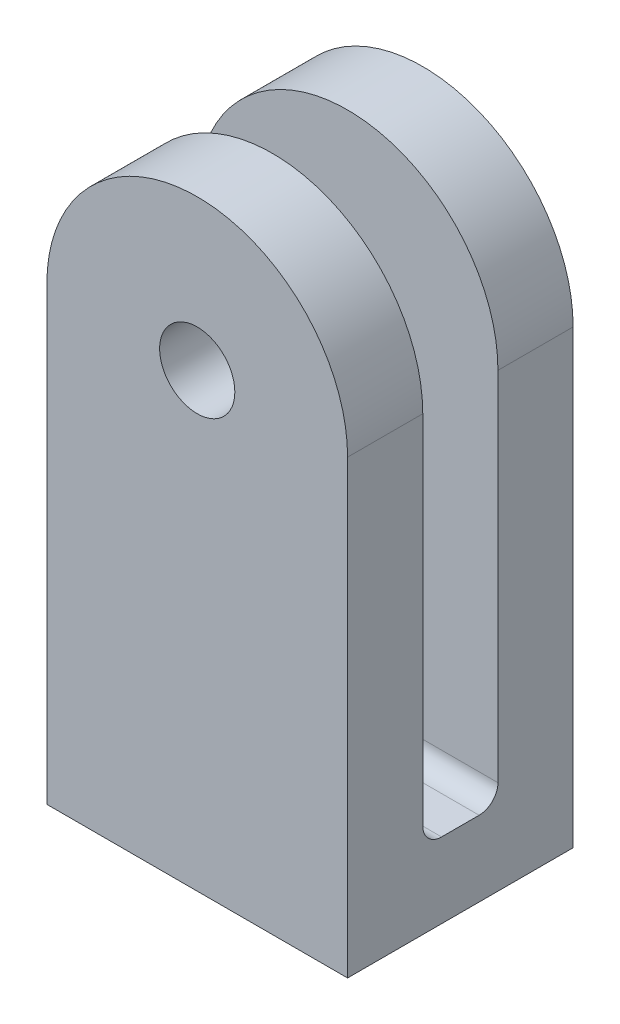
ISO-10303-21;
HEADER;
FILE_DESCRIPTION(('STEP AP214'),'2;1');
FILE_NAME('part.step','',(''),(''),'','','');
FILE_SCHEMA(('AUTOMOTIVE_DESIGN { 1 0 10303 214 1 1 1 1 }'));
ENDSEC;
DATA;
#1=APPLICATION_CONTEXT('core data for automotive mechanical design processes');
#2=APPLICATION_PROTOCOL_DEFINITION('international standard','automotive_design',2000,#1);
#3=PRODUCT_CONTEXT('',#1,'mechanical');
#4=PRODUCT('Part','Part','',(#3));
#5=PRODUCT_RELATED_PRODUCT_CATEGORY('part','',(#4));
#6=PRODUCT_DEFINITION_FORMATION('','',#4);
#7=PRODUCT_DEFINITION_CONTEXT('part definition',#1,'design');
#8=PRODUCT_DEFINITION('design','',#6,#7);
#9=PRODUCT_DEFINITION_SHAPE('','',#8);
#10=(LENGTH_UNIT() NAMED_UNIT(*) SI_UNIT(.MILLI.,.METRE.));
#11=(NAMED_UNIT(*) PLANE_ANGLE_UNIT() SI_UNIT($,.RADIAN.));
#12=(NAMED_UNIT(*) SI_UNIT($,.STERADIAN.) SOLID_ANGLE_UNIT());
#13=UNCERTAINTY_MEASURE_WITH_UNIT(LENGTH_MEASURE(1.E-05),#10,'distance_accuracy_value','');
#14=(GEOMETRIC_REPRESENTATION_CONTEXT(3) GLOBAL_UNCERTAINTY_ASSIGNED_CONTEXT((#13)) GLOBAL_UNIT_ASSIGNED_CONTEXT((#10,
#11,#12)) REPRESENTATION_CONTEXT('',''));
#15=CARTESIAN_POINT('',(0.,0.,0.));
#16=DIRECTION('',(0.,0.,1.));
#17=DIRECTION('',(1.,0.,0.));
#18=AXIS2_PLACEMENT_3D('',#15,#16,#17);
#19=CARTESIAN_POINT('',(0.,76.2,19.05));
#20=DIRECTION('',(0.,0.,-1.));
#21=DIRECTION('',(-1.,0.,0.));
#22=AXIS2_PLACEMENT_3D('',#19,#20,#21);
#23=CYLINDRICAL_SURFACE('',#22,25.4);
#24=DIRECTION('',(0.,0.,-1.));
#25=VECTOR('',#24,1.);
#26=CARTESIAN_POINT('',(25.4,76.2,19.05));
#27=LINE('',#26,#25);
#28=CARTESIAN_POINT('',(25.4,76.2,19.05));
#29=VERTEX_POINT('',#28);
#30=CARTESIAN_POINT('',(25.4,76.2,6.35000000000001));
#31=VERTEX_POINT('',#30);
#32=EDGE_CURVE('E184',#29,#31,#27,.T.);
#33=ORIENTED_EDGE('',*,*,#32,.T.);
#34=CARTESIAN_POINT('',(0.,76.2,6.35000000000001));
#35=DIRECTION('',(0.,0.,1.));
#36=DIRECTION('',(0.,-1.,0.));
#37=AXIS2_PLACEMENT_3D('',#34,#35,#36);
#38=CIRCLE('',#37,25.4);
#39=CARTESIAN_POINT('',(-25.4,76.2,6.35000000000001));
#40=VERTEX_POINT('',#39);
#41=EDGE_CURVE('E11',#31,#40,#38,.T.);
#42=ORIENTED_EDGE('',*,*,#41,.T.);
#43=DIRECTION('',(0.,0.,-1.));
#44=VECTOR('',#43,1.);
#45=CARTESIAN_POINT('',(-25.4,76.2,19.05));
#46=LINE('',#45,#44);
#47=CARTESIAN_POINT('',(-25.4,76.2,19.05));
#48=VERTEX_POINT('',#47);
#49=EDGE_CURVE('E141',#48,#40,#46,.T.);
#50=ORIENTED_EDGE('',*,*,#49,.F.);
#51=CARTESIAN_POINT('',(0.,76.2,19.05));
#52=DIRECTION('',(0.,0.,1.));
#53=DIRECTION('',(-1.,0.,0.));
#54=AXIS2_PLACEMENT_3D('',#51,#52,#53);
#55=CIRCLE('',#54,25.4);
#56=EDGE_CURVE('E49',#29,#48,#55,.T.);
#57=ORIENTED_EDGE('',*,*,#56,.F.);
#58=EDGE_LOOP('',(#33,#42,#50,#57));
#59=FACE_BOUND('',#58,.T.);
#60=ADVANCED_FACE('F31',(#59),#23,.T.);
#61=CARTESIAN_POINT('',(-25.4,0.,19.05));
#62=DIRECTION('',(1.,0.,0.));
#63=DIRECTION('',(0.,0.,-1.));
#64=AXIS2_PLACEMENT_3D('',#61,#62,#63);
#65=PLANE('',#64);
#66=ORIENTED_EDGE('',*,*,#49,.T.);
#67=DIRECTION('',(0.,-1.,0.));
#68=VECTOR('',#67,1.);
#69=CARTESIAN_POINT('',(-25.4,101.6,6.35000000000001));
#70=LINE('',#69,#68);
#71=CARTESIAN_POINT('',(-25.4,15.875,6.35));
#72=VERTEX_POINT('',#71);
#73=EDGE_CURVE('E123',#40,#72,#70,.T.);
#74=ORIENTED_EDGE('',*,*,#73,.T.);
#75=CARTESIAN_POINT('',(-25.4,15.875,3.175));
#76=DIRECTION('',(1.,0.,0.));
#77=DIRECTION('',(0.,0.,-1.));
#78=AXIS2_PLACEMENT_3D('',#75,#76,#77);
#79=CIRCLE('',#78,3.175);
#80=CARTESIAN_POINT('',(-25.4,12.7,3.17500000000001));
#81=VERTEX_POINT('',#80);
#82=EDGE_CURVE('E133',#72,#81,#79,.T.);
#83=ORIENTED_EDGE('',*,*,#82,.T.);
#84=DIRECTION('',(0.,0.,-1.));
#85=VECTOR('',#84,1.);
#86=CARTESIAN_POINT('',(-25.4,12.7,3.17500000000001));
#87=LINE('',#86,#85);
#88=CARTESIAN_POINT('',(-25.4,12.7,-3.17500000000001));
#89=VERTEX_POINT('',#88);
#90=EDGE_CURVE('E137',#81,#89,#87,.T.);
#91=ORIENTED_EDGE('',*,*,#90,.T.);
#92=CARTESIAN_POINT('',(-25.4,15.875,-3.175));
#93=DIRECTION('',(1.,0.,0.));
#94=DIRECTION('',(0.,0.,-1.));
#95=AXIS2_PLACEMENT_3D('',#92,#93,#94);
#96=CIRCLE('',#95,3.175);
#97=CARTESIAN_POINT('',(-25.4,15.875,-6.35));
#98=VERTEX_POINT('',#97);
#99=EDGE_CURVE('E152',#89,#98,#96,.T.);
#100=ORIENTED_EDGE('',*,*,#99,.T.);
#101=DIRECTION('',(0.,1.,0.));
#102=VECTOR('',#101,1.);
#103=CARTESIAN_POINT('',(-25.4,101.6,-6.34999999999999));
#104=LINE('',#103,#102);
#105=CARTESIAN_POINT('',(-25.4,76.2,-6.34999999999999));
#106=VERTEX_POINT('',#105);
#107=EDGE_CURVE('E130',#98,#106,#104,.T.);
#108=ORIENTED_EDGE('',*,*,#107,.T.);
#109=CARTESIAN_POINT('',(-25.4,76.2,-19.05));
#110=VERTEX_POINT('',#109);
#111=EDGE_CURVE('E75',#106,#110,#46,.T.);
#112=ORIENTED_EDGE('',*,*,#111,.T.);
#113=DIRECTION('',(0.,-1.,0.));
#114=VECTOR('',#113,1.);
#115=CARTESIAN_POINT('',(-25.4,0.,-19.05));
#116=LINE('',#115,#114);
#117=CARTESIAN_POINT('',(-25.4,0.,-19.05));
#118=VERTEX_POINT('',#117);
#119=EDGE_CURVE('E166',#110,#118,#116,.T.);
#120=ORIENTED_EDGE('',*,*,#119,.T.);
#121=DIRECTION('',(0.,0.,-1.));
#122=VECTOR('',#121,1.);
#123=CARTESIAN_POINT('',(-25.4,0.,19.05));
#124=LINE('',#123,#122);
#125=CARTESIAN_POINT('',(-25.4,0.,19.05));
#126=VERTEX_POINT('',#125);
#127=EDGE_CURVE('E190',#126,#118,#124,.T.);
#128=ORIENTED_EDGE('',*,*,#127,.F.);
#129=DIRECTION('',(0.,-1.,0.));
#130=VECTOR('',#129,1.);
#131=CARTESIAN_POINT('',(-25.4,0.,19.05));
#132=LINE('',#131,#130);
#133=EDGE_CURVE('E170',#48,#126,#132,.T.);
#134=ORIENTED_EDGE('',*,*,#133,.F.);
#135=EDGE_LOOP('',(#66,#74,#83,#91,#100,#108,#112,#120,#128,#134));
#136=FACE_BOUND('',#135,.T.);
#137=ADVANCED_FACE('F33',(#136),#65,.F.);
#138=CARTESIAN_POINT('',(-25.4,0.,19.05));
#139=DIRECTION('',(0.,1.,0.));
#140=DIRECTION('',(0.,0.,1.));
#141=AXIS2_PLACEMENT_3D('',#138,#139,#140);
#142=PLANE('',#141);
#143=DIRECTION('',(1.,0.,0.));
#144=VECTOR('',#143,1.);
#145=CARTESIAN_POINT('',(-25.4,0.,-19.05));
#146=LINE('',#145,#144);
#147=CARTESIAN_POINT('',(25.4,0.,-19.05));
#148=VERTEX_POINT('',#147);
#149=EDGE_CURVE('E178',#118,#148,#146,.T.);
#150=ORIENTED_EDGE('',*,*,#149,.T.);
#151=DIRECTION('',(0.,0.,-1.));
#152=VECTOR('',#151,1.);
#153=CARTESIAN_POINT('',(25.4,0.,19.05));
#154=LINE('',#153,#152);
#155=CARTESIAN_POINT('',(25.4,0.,19.05));
#156=VERTEX_POINT('',#155);
#157=EDGE_CURVE('E187',#156,#148,#154,.T.);
#158=ORIENTED_EDGE('',*,*,#157,.F.);
#159=DIRECTION('',(1.,0.,0.));
#160=VECTOR('',#159,1.);
#161=CARTESIAN_POINT('',(-25.4,0.,19.05));
#162=LINE('',#161,#160);
#163=EDGE_CURVE('E82',#126,#156,#162,.T.);
#164=ORIENTED_EDGE('',*,*,#163,.F.);
#165=ORIENTED_EDGE('',*,*,#127,.T.);
#166=EDGE_LOOP('',(#150,#158,#164,#165));
#167=FACE_BOUND('',#166,.T.);
#168=ADVANCED_FACE('F207',(#167),#142,.F.);
#169=CARTESIAN_POINT('',(25.4,0.,19.05));
#170=DIRECTION('',(-1.,0.,0.));
#171=DIRECTION('',(0.,0.,1.));
#172=AXIS2_PLACEMENT_3D('',#169,#170,#171);
#173=PLANE('',#172);
#174=CARTESIAN_POINT('',(25.4,15.875,3.175));
#175=DIRECTION('',(1.,0.,0.));
#176=DIRECTION('',(0.,0.,-1.));
#177=AXIS2_PLACEMENT_3D('',#174,#175,#176);
#178=CIRCLE('',#177,3.175);
#179=CARTESIAN_POINT('',(25.4,15.875,6.35));
#180=VERTEX_POINT('',#179);
#181=CARTESIAN_POINT('',(25.4,12.7,3.17500000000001));
#182=VERTEX_POINT('',#181);
#183=EDGE_CURVE('E157',#180,#182,#178,.T.);
#184=ORIENTED_EDGE('',*,*,#183,.F.);
#185=DIRECTION('',(0.,-1.,0.));
#186=VECTOR('',#185,1.);
#187=CARTESIAN_POINT('',(25.4,101.6,6.35000000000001));
#188=LINE('',#187,#186);
#189=EDGE_CURVE('E125',#31,#180,#188,.T.);
#190=ORIENTED_EDGE('',*,*,#189,.F.);
#191=ORIENTED_EDGE('',*,*,#32,.F.);
#192=DIRECTION('',(0.,1.,0.));
#193=VECTOR('',#192,1.);
#194=CARTESIAN_POINT('',(25.4,0.,19.05));
#195=LINE('',#194,#193);
#196=EDGE_CURVE('E174',#156,#29,#195,.T.);
#197=ORIENTED_EDGE('',*,*,#196,.F.);
#198=ORIENTED_EDGE('',*,*,#157,.T.);
#199=DIRECTION('',(0.,1.,0.));
#200=VECTOR('',#199,1.);
#201=CARTESIAN_POINT('',(25.4,0.,-19.05));
#202=LINE('',#201,#200);
#203=CARTESIAN_POINT('',(25.4,76.2,-19.05));
#204=VERTEX_POINT('',#203);
#205=EDGE_CURVE('E180',#148,#204,#202,.T.);
#206=ORIENTED_EDGE('',*,*,#205,.T.);
#207=CARTESIAN_POINT('',(25.4,76.2,-6.34999999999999));
#208=VERTEX_POINT('',#207);
#209=EDGE_CURVE('E67',#208,#204,#27,.T.);
#210=ORIENTED_EDGE('',*,*,#209,.F.);
#211=DIRECTION('',(0.,1.,0.));
#212=VECTOR('',#211,1.);
#213=CARTESIAN_POINT('',(25.4,101.6,-6.34999999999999));
#214=LINE('',#213,#212);
#215=CARTESIAN_POINT('',(25.4,15.875,-6.35));
#216=VERTEX_POINT('',#215);
#217=EDGE_CURVE('E142',#216,#208,#214,.T.);
#218=ORIENTED_EDGE('',*,*,#217,.F.);
#219=CARTESIAN_POINT('',(25.4,15.875,-3.175));
#220=DIRECTION('',(1.,0.,0.));
#221=DIRECTION('',(0.,0.,-1.));
#222=AXIS2_PLACEMENT_3D('',#219,#220,#221);
#223=CIRCLE('',#222,3.175);
#224=CARTESIAN_POINT('',(25.4,12.7,-3.17500000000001));
#225=VERTEX_POINT('',#224);
#226=EDGE_CURVE('E145',#225,#216,#223,.T.);
#227=ORIENTED_EDGE('',*,*,#226,.F.);
#228=DIRECTION('',(0.,0.,-1.));
#229=VECTOR('',#228,1.);
#230=CARTESIAN_POINT('',(25.4,12.7,3.17500000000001));
#231=LINE('',#230,#229);
#232=EDGE_CURVE('E159',#182,#225,#231,.T.);
#233=ORIENTED_EDGE('',*,*,#232,.F.);
#234=EDGE_LOOP('',(#184,#190,#191,#197,#198,#206,#210,#218,#227,#233));
#235=FACE_BOUND('',#234,.T.);
#236=ADVANCED_FACE('F199',(#235),#173,.F.);
#237=CARTESIAN_POINT('',(0.,76.2,-6.34999999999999));
#238=DIRECTION('',(0.,0.,-1.));
#239=DIRECTION('',(0.,1.,0.));
#240=AXIS2_PLACEMENT_3D('',#237,#238,#239);
#241=CIRCLE('',#240,25.4);
#242=EDGE_CURVE('E41',#106,#208,#241,.T.);
#243=ORIENTED_EDGE('',*,*,#242,.T.);
#244=ORIENTED_EDGE('',*,*,#209,.T.);
#245=CARTESIAN_POINT('',(0.,76.2,-19.05));
#246=DIRECTION('',(0.,0.,1.));
#247=DIRECTION('',(-1.,0.,0.));
#248=AXIS2_PLACEMENT_3D('',#245,#246,#247);
#249=CIRCLE('',#248,25.4);
#250=EDGE_CURVE('E172',#204,#110,#249,.T.);
#251=ORIENTED_EDGE('',*,*,#250,.T.);
#252=ORIENTED_EDGE('',*,*,#111,.F.);
#253=EDGE_LOOP('',(#243,#244,#251,#252));
#254=FACE_BOUND('',#253,.T.);
#255=ADVANCED_FACE('F192',(#254),#23,.T.);
#256=CARTESIAN_POINT('',(0.,76.2,19.05));
#257=DIRECTION('',(0.,0.,-1.));
#258=DIRECTION('',(-1.,0.,0.));
#259=AXIS2_PLACEMENT_3D('',#256,#257,#258);
#260=PLANE('',#259);
#261=CARTESIAN_POINT('',(0.,76.2,19.05));
#262=DIRECTION('',(0.,0.,1.));
#263=DIRECTION('',(1.,0.,0.));
#264=AXIS2_PLACEMENT_3D('',#261,#262,#263);
#265=CIRCLE('',#264,6.35);
#266=CARTESIAN_POINT('',(6.35,76.2,19.05));
#267=VERTEX_POINT('',#266);
#268=EDGE_CURVE('E323',#267,#267,#265,.T.);
#269=ORIENTED_EDGE('',*,*,#268,.F.);
#270=EDGE_LOOP('',(#269));
#271=FACE_BOUND('',#270,.T.);
#272=ORIENTED_EDGE('',*,*,#133,.T.);
#273=ORIENTED_EDGE('',*,*,#163,.T.);
#274=ORIENTED_EDGE('',*,*,#196,.T.);
#275=ORIENTED_EDGE('',*,*,#56,.T.);
#276=EDGE_LOOP('',(#272,#273,#274,#275));
#277=FACE_BOUND('',#276,.T.);
#278=ADVANCED_FACE('F209',(#271,#277),#260,.F.);
#279=CARTESIAN_POINT('',(0.,76.2,-19.05));
#280=DIRECTION('',(0.,0.,-1.));
#281=DIRECTION('',(-1.,0.,0.));
#282=AXIS2_PLACEMENT_3D('',#279,#280,#281);
#283=PLANE('',#282);
#284=CARTESIAN_POINT('',(0.,76.2,-19.05));
#285=DIRECTION('',(0.,0.,1.));
#286=DIRECTION('',(1.,0.,0.));
#287=AXIS2_PLACEMENT_3D('',#284,#285,#286);
#288=CIRCLE('',#287,6.35);
#289=CARTESIAN_POINT('',(6.35,76.2,-19.05));
#290=VERTEX_POINT('',#289);
#291=EDGE_CURVE('E327',#290,#290,#288,.T.);
#292=ORIENTED_EDGE('',*,*,#291,.T.);
#293=EDGE_LOOP('',(#292));
#294=FACE_BOUND('',#293,.T.);
#295=ORIENTED_EDGE('',*,*,#119,.F.);
#296=ORIENTED_EDGE('',*,*,#250,.F.);
#297=ORIENTED_EDGE('',*,*,#205,.F.);
#298=ORIENTED_EDGE('',*,*,#149,.F.);
#299=EDGE_LOOP('',(#295,#296,#297,#298));
#300=FACE_BOUND('',#299,.T.);
#301=ADVANCED_FACE('F205',(#294,#300),#283,.T.);
#302=CARTESIAN_POINT('',(-25.4,101.6,6.35000000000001));
#303=DIRECTION('',(0.,0.,1.));
#304=DIRECTION('',(0.,-1.,0.));
#305=AXIS2_PLACEMENT_3D('',#302,#303,#304);
#306=PLANE('',#305);
#307=CARTESIAN_POINT('',(0.,76.2,6.35000000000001));
#308=DIRECTION('',(0.,0.,1.));
#309=DIRECTION('',(0.,-1.,0.));
#310=AXIS2_PLACEMENT_3D('',#307,#308,#309);
#311=CIRCLE('',#310,6.35);
#312=CARTESIAN_POINT('',(6.35,76.2,6.35000000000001));
#313=VERTEX_POINT('',#312);
#314=EDGE_CURVE('E148',#313,#313,#311,.T.);
#315=ORIENTED_EDGE('',*,*,#314,.T.);
#316=EDGE_LOOP('',(#315));
#317=FACE_BOUND('',#316,.T.);
#318=ORIENTED_EDGE('',*,*,#189,.T.);
#319=DIRECTION('',(1.,0.,0.));
#320=VECTOR('',#319,1.);
#321=CARTESIAN_POINT('',(-25.4,15.875,6.35));
#322=LINE('',#321,#320);
#323=EDGE_CURVE('E119',#72,#180,#322,.T.);
#324=ORIENTED_EDGE('',*,*,#323,.F.);
#325=ORIENTED_EDGE('',*,*,#73,.F.);
#326=ORIENTED_EDGE('',*,*,#41,.F.);
#327=EDGE_LOOP('',(#318,#324,#325,#326));
#328=FACE_BOUND('',#327,.T.);
#329=ADVANCED_FACE('F121',(#317,#328),#306,.F.);
#330=CARTESIAN_POINT('',(-25.4,101.6,-6.34999999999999));
#331=DIRECTION('',(0.,0.,-1.));
#332=DIRECTION('',(0.,1.,0.));
#333=AXIS2_PLACEMENT_3D('',#330,#331,#332);
#334=PLANE('',#333);
#335=CARTESIAN_POINT('',(0.,76.2,-6.34999999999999));
#336=DIRECTION('',(0.,0.,-1.));
#337=DIRECTION('',(0.,1.,0.));
#338=AXIS2_PLACEMENT_3D('',#335,#336,#337);
#339=CIRCLE('',#338,6.35);
#340=CARTESIAN_POINT('',(6.35,76.2,-6.34999999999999));
#341=VERTEX_POINT('',#340);
#342=EDGE_CURVE('E35',#341,#341,#339,.T.);
#343=ORIENTED_EDGE('',*,*,#342,.T.);
#344=EDGE_LOOP('',(#343));
#345=FACE_BOUND('',#344,.T.);
#346=ORIENTED_EDGE('',*,*,#242,.F.);
#347=ORIENTED_EDGE('',*,*,#107,.F.);
#348=DIRECTION('',(1.,0.,0.));
#349=VECTOR('',#348,1.);
#350=CARTESIAN_POINT('',(-25.4,15.875,-6.35));
#351=LINE('',#350,#349);
#352=EDGE_CURVE('E164',#98,#216,#351,.T.);
#353=ORIENTED_EDGE('',*,*,#352,.T.);
#354=ORIENTED_EDGE('',*,*,#217,.T.);
#355=EDGE_LOOP('',(#346,#347,#353,#354));
#356=FACE_BOUND('',#355,.T.);
#357=ADVANCED_FACE('F196',(#345,#356),#334,.F.);
#358=CARTESIAN_POINT('',(-25.4,15.875,-3.175));
#359=DIRECTION('',(1.,0.,0.));
#360=DIRECTION('',(0.,0.,-1.));
#361=AXIS2_PLACEMENT_3D('',#358,#359,#360);
#362=CYLINDRICAL_SURFACE('',#361,3.175);
#363=ORIENTED_EDGE('',*,*,#226,.T.);
#364=ORIENTED_EDGE('',*,*,#352,.F.);
#365=ORIENTED_EDGE('',*,*,#99,.F.);
#366=DIRECTION('',(1.,0.,0.));
#367=VECTOR('',#366,1.);
#368=CARTESIAN_POINT('',(-25.4,12.7,-3.17500000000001));
#369=LINE('',#368,#367);
#370=EDGE_CURVE('E167',#89,#225,#369,.T.);
#371=ORIENTED_EDGE('',*,*,#370,.T.);
#372=EDGE_LOOP('',(#363,#364,#365,#371));
#373=FACE_BOUND('',#372,.T.);
#374=ADVANCED_FACE('F248',(#373),#362,.F.);
#375=CARTESIAN_POINT('',(-25.4,12.7,3.17500000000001));
#376=DIRECTION('',(0.,-1.,0.));
#377=DIRECTION('',(0.,0.,-1.));
#378=AXIS2_PLACEMENT_3D('',#375,#376,#377);
#379=PLANE('',#378);
#380=ORIENTED_EDGE('',*,*,#232,.T.);
#381=ORIENTED_EDGE('',*,*,#370,.F.);
#382=ORIENTED_EDGE('',*,*,#90,.F.);
#383=DIRECTION('',(1.,0.,0.));
#384=VECTOR('',#383,1.);
#385=CARTESIAN_POINT('',(-25.4,12.7,3.17500000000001));
#386=LINE('',#385,#384);
#387=EDGE_CURVE('E129',#81,#182,#386,.T.);
#388=ORIENTED_EDGE('',*,*,#387,.T.);
#389=EDGE_LOOP('',(#380,#381,#382,#388));
#390=FACE_BOUND('',#389,.T.);
#391=ADVANCED_FACE('F253',(#390),#379,.F.);
#392=CARTESIAN_POINT('',(-25.4,15.875,3.175));
#393=DIRECTION('',(1.,0.,0.));
#394=DIRECTION('',(0.,0.,-1.));
#395=AXIS2_PLACEMENT_3D('',#392,#393,#394);
#396=CYLINDRICAL_SURFACE('',#395,3.175);
#397=ORIENTED_EDGE('',*,*,#183,.T.);
#398=ORIENTED_EDGE('',*,*,#387,.F.);
#399=ORIENTED_EDGE('',*,*,#82,.F.);
#400=ORIENTED_EDGE('',*,*,#323,.T.);
#401=EDGE_LOOP('',(#397,#398,#399,#400));
#402=FACE_BOUND('',#401,.T.);
#403=ADVANCED_FACE('F134',(#402),#396,.F.);
#404=CARTESIAN_POINT('',(0.,76.2,-19.05));
#405=DIRECTION('',(0.,0.,1.));
#406=DIRECTION('',(1.,0.,0.));
#407=AXIS2_PLACEMENT_3D('',#404,#405,#406);
#408=CYLINDRICAL_SURFACE('',#407,6.35);
#409=CARTESIAN_POINT('',(6.35,76.2,-19.05));
#410=CARTESIAN_POINT('',(6.35,76.2,-18.9177083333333));
#411=CARTESIAN_POINT('',(6.35,76.2,-18.7854166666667));
#412=CARTESIAN_POINT('',(6.35,76.2,-18.5208333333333));
#413=CARTESIAN_POINT('',(6.35,76.2,-18.3885416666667));
#414=CARTESIAN_POINT('',(6.35,76.2,-18.1239583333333));
#415=CARTESIAN_POINT('',(6.35,76.2,-17.9916666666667));
#416=CARTESIAN_POINT('',(6.35,76.2,-17.7270833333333));
#417=CARTESIAN_POINT('',(6.35,76.2,-17.5947916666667));
#418=CARTESIAN_POINT('',(6.35,76.2,-17.3302083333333));
#419=CARTESIAN_POINT('',(6.35,76.2,-17.1979166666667));
#420=CARTESIAN_POINT('',(6.35,76.2,-16.9333333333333));
#421=CARTESIAN_POINT('',(6.35,76.2,-16.8010416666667));
#422=CARTESIAN_POINT('',(6.35,76.2,-16.5364583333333));
#423=CARTESIAN_POINT('',(6.35,76.2,-16.4041666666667));
#424=CARTESIAN_POINT('',(6.35,76.2,-16.1395833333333));
#425=CARTESIAN_POINT('',(6.35,76.2,-16.0072916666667));
#426=CARTESIAN_POINT('',(6.35,76.2,-15.7427083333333));
#427=CARTESIAN_POINT('',(6.35,76.2,-15.6104166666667));
#428=CARTESIAN_POINT('',(6.35,76.2,-15.3458333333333));
#429=CARTESIAN_POINT('',(6.35,76.2,-15.2135416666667));
#430=CARTESIAN_POINT('',(6.35,76.2,-14.9489583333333));
#431=CARTESIAN_POINT('',(6.35,76.2,-14.8166666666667));
#432=CARTESIAN_POINT('',(6.35,76.2,-14.5520833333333));
#433=CARTESIAN_POINT('',(6.35,76.2,-14.4197916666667));
#434=CARTESIAN_POINT('',(6.35,76.2,-14.1552083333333));
#435=CARTESIAN_POINT('',(6.35,76.2,-14.0229166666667));
#436=CARTESIAN_POINT('',(6.35,76.2,-13.7583333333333));
#437=CARTESIAN_POINT('',(6.35,76.2,-13.6260416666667));
#438=CARTESIAN_POINT('',(6.35,76.2,-13.3614583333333));
#439=CARTESIAN_POINT('',(6.35,76.2,-13.2291666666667));
#440=CARTESIAN_POINT('',(6.35,76.2,-12.9645833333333));
#441=CARTESIAN_POINT('',(6.35,76.2,-12.8322916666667));
#442=CARTESIAN_POINT('',(6.35,76.2,-12.5677083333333));
#443=CARTESIAN_POINT('',(6.35,76.2,-12.4354166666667));
#444=CARTESIAN_POINT('',(6.35,76.2,-12.1708333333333));
#445=CARTESIAN_POINT('',(6.35,76.2,-12.0385416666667));
#446=CARTESIAN_POINT('',(6.35,76.2,-11.7739583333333));
#447=CARTESIAN_POINT('',(6.35,76.2,-11.6416666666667));
#448=CARTESIAN_POINT('',(6.35,76.2,-11.3770833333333));
#449=CARTESIAN_POINT('',(6.35,76.2,-11.2447916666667));
#450=CARTESIAN_POINT('',(6.35,76.2,-10.9802083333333));
#451=CARTESIAN_POINT('',(6.35,76.2,-10.8479166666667));
#452=CARTESIAN_POINT('',(6.35,76.2,-10.5833333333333));
#453=CARTESIAN_POINT('',(6.35,76.2,-10.4510416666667));
#454=CARTESIAN_POINT('',(6.35,76.2,-10.1864583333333));
#455=CARTESIAN_POINT('',(6.35,76.2,-10.0541666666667));
#456=CARTESIAN_POINT('',(6.35,76.2,-9.78958333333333));
#457=CARTESIAN_POINT('',(6.35,76.2,-9.65729166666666));
#458=CARTESIAN_POINT('',(6.35,76.2,-9.39270833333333));
#459=CARTESIAN_POINT('',(6.35,76.2,-9.26041666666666));
#460=CARTESIAN_POINT('',(6.35,76.2,-8.99583333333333));
#461=CARTESIAN_POINT('',(6.35,76.2,-8.86354166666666));
#462=CARTESIAN_POINT('',(6.35,76.2,-8.59895833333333));
#463=CARTESIAN_POINT('',(6.35,76.2,-8.46666666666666));
#464=CARTESIAN_POINT('',(6.35,76.2,-8.20208333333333));
#465=CARTESIAN_POINT('',(6.35,76.2,-8.06979166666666));
#466=CARTESIAN_POINT('',(6.35,76.2,-7.80520833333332));
#467=CARTESIAN_POINT('',(6.35,76.2,-7.67291666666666));
#468=CARTESIAN_POINT('',(6.35,76.2,-7.40833333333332));
#469=CARTESIAN_POINT('',(6.35,76.2,-7.27604166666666));
#470=CARTESIAN_POINT('',(6.35,76.2,-7.01145833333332));
#471=CARTESIAN_POINT('',(6.35,76.2,-6.87916666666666));
#472=CARTESIAN_POINT('',(6.35,76.2,-6.61458333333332));
#473=CARTESIAN_POINT('',(6.35,76.2,-6.48229166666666));
#474=CARTESIAN_POINT('',(6.35,76.2,-6.34999999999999));
#475=B_SPLINE_CURVE_WITH_KNOTS('',3,(#409,#410,#411,#412,#413,#414,#415,#416,#417,#418,#419,
#420,#421,#422,#423,#424,#425,#426,#427,#428,#429,#430,#431,#432,#433,#434,#435,#436,#437,#438,
#439,#440,#441,#442,#443,#444,#445,#446,#447,#448,#449,#450,#451,#452,#453,#454,#455,#456,#457,
#458,#459,#460,#461,#462,#463,#464,#465,#466,#467,#468,#469,#470,#471,#472,#473,#474),
.UNSPECIFIED.,.F.,.F.,(4,2,2,2,2,2,2,2,2,2,2,2,2,2,2,2,2,2,2,2,2,2,2,2,2,2,2,2,2,2,2,2,4),(0.,
0.396874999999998,0.793749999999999,1.190625,1.5875,1.984375,2.38125,2.778125,3.175,3.571875,
3.96875,4.365625,4.7625,5.159375,5.55625,5.953125,6.35,6.74687500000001,7.14375000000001,
7.54062500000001,7.93750000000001,8.33437500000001,8.73125000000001,9.12812500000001,
9.52500000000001,9.92187500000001,10.31875,10.715625,11.1125,11.509375,11.90625,12.303125,12.7),.UNSPECIFIED.);
#476=EDGE_CURVE('BSEAM273',#290,#341,#475,.T.);
#477=ORIENTED_EDGE('',*,*,#291,.F.);
#478=ORIENTED_EDGE('',*,*,#342,.F.);
#479=ORIENTED_EDGE('',*,*,#476,.T.);
#480=ORIENTED_EDGE('',*,*,#476,.F.);
#481=EDGE_LOOP('',(#477,#479,#478,#480));
#482=FACE_BOUND('',#481,.T.);
#483=ADVANCED_FACE('F273',(#482),#408,.F.);
#484=CARTESIAN_POINT('',(6.35,76.2,19.05));
#485=CARTESIAN_POINT('',(6.35,76.2,18.9177083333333));
#486=CARTESIAN_POINT('',(6.35,76.2,18.7854166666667));
#487=CARTESIAN_POINT('',(6.35,76.2,18.5208333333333));
#488=CARTESIAN_POINT('',(6.35,76.2,18.3885416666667));
#489=CARTESIAN_POINT('',(6.35,76.2,18.1239583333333));
#490=CARTESIAN_POINT('',(6.35,76.2,17.9916666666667));
#491=CARTESIAN_POINT('',(6.35,76.2,17.7270833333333));
#492=CARTESIAN_POINT('',(6.35,76.2,17.5947916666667));
#493=CARTESIAN_POINT('',(6.35,76.2,17.3302083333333));
#494=CARTESIAN_POINT('',(6.35,76.2,17.1979166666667));
#495=CARTESIAN_POINT('',(6.35,76.2,16.9333333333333));
#496=CARTESIAN_POINT('',(6.35,76.2,16.8010416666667));
#497=CARTESIAN_POINT('',(6.35,76.2,16.5364583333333));
#498=CARTESIAN_POINT('',(6.35,76.2,16.4041666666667));
#499=CARTESIAN_POINT('',(6.35,76.2,16.1395833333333));
#500=CARTESIAN_POINT('',(6.35,76.2,16.0072916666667));
#501=CARTESIAN_POINT('',(6.35,76.2,15.7427083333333));
#502=CARTESIAN_POINT('',(6.35,76.2,15.6104166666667));
#503=CARTESIAN_POINT('',(6.35,76.2,15.3458333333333));
#504=CARTESIAN_POINT('',(6.35,76.2,15.2135416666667));
#505=CARTESIAN_POINT('',(6.35,76.2,14.9489583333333));
#506=CARTESIAN_POINT('',(6.35,76.2,14.8166666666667));
#507=CARTESIAN_POINT('',(6.35,76.2,14.5520833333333));
#508=CARTESIAN_POINT('',(6.35,76.2,14.4197916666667));
#509=CARTESIAN_POINT('',(6.35,76.2,14.1552083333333));
#510=CARTESIAN_POINT('',(6.35,76.2,14.0229166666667));
#511=CARTESIAN_POINT('',(6.35,76.2,13.7583333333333));
#512=CARTESIAN_POINT('',(6.35,76.2,13.6260416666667));
#513=CARTESIAN_POINT('',(6.35,76.2,13.3614583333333));
#514=CARTESIAN_POINT('',(6.35,76.2,13.2291666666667));
#515=CARTESIAN_POINT('',(6.35,76.2,12.9645833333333));
#516=CARTESIAN_POINT('',(6.35,76.2,12.8322916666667));
#517=CARTESIAN_POINT('',(6.35,76.2,12.5677083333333));
#518=CARTESIAN_POINT('',(6.35,76.2,12.4354166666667));
#519=CARTESIAN_POINT('',(6.35,76.2,12.1708333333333));
#520=CARTESIAN_POINT('',(6.35,76.2,12.0385416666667));
#521=CARTESIAN_POINT('',(6.35,76.2,11.7739583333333));
#522=CARTESIAN_POINT('',(6.35,76.2,11.6416666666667));
#523=CARTESIAN_POINT('',(6.35,76.2,11.3770833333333));
#524=CARTESIAN_POINT('',(6.35,76.2,11.2447916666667));
#525=CARTESIAN_POINT('',(6.35,76.2,10.9802083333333));
#526=CARTESIAN_POINT('',(6.35,76.2,10.8479166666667));
#527=CARTESIAN_POINT('',(6.35,76.2,10.5833333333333));
#528=CARTESIAN_POINT('',(6.35,76.2,10.4510416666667));
#529=CARTESIAN_POINT('',(6.35,76.2,10.1864583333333));
#530=CARTESIAN_POINT('',(6.35,76.2,10.0541666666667));
#531=CARTESIAN_POINT('',(6.35,76.2,9.78958333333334));
#532=CARTESIAN_POINT('',(6.35,76.2,9.65729166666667));
#533=CARTESIAN_POINT('',(6.35,76.2,9.39270833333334));
#534=CARTESIAN_POINT('',(6.35,76.2,9.26041666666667));
#535=CARTESIAN_POINT('',(6.35,76.2,8.99583333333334));
#536=CARTESIAN_POINT('',(6.35,76.2,8.86354166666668));
#537=CARTESIAN_POINT('',(6.35,76.2,8.59895833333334));
#538=CARTESIAN_POINT('',(6.35,76.2,8.46666666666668));
#539=CARTESIAN_POINT('',(6.35,76.2,8.20208333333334));
#540=CARTESIAN_POINT('',(6.35,76.2,8.06979166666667));
#541=CARTESIAN_POINT('',(6.35,76.2,7.80520833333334));
#542=CARTESIAN_POINT('',(6.35,76.2,7.67291666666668));
#543=CARTESIAN_POINT('',(6.35,76.2,7.40833333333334));
#544=CARTESIAN_POINT('',(6.35,76.2,7.27604166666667));
#545=CARTESIAN_POINT('',(6.35,76.2,7.01145833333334));
#546=CARTESIAN_POINT('',(6.35,76.2,6.87916666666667));
#547=CARTESIAN_POINT('',(6.35,76.2,6.61458333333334));
#548=CARTESIAN_POINT('',(6.35,76.2,6.48229166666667));
#549=CARTESIAN_POINT('',(6.35,76.2,6.35000000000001));
#550=B_SPLINE_CURVE_WITH_KNOTS('',3,(#484,#485,#486,#487,#488,#489,#490,#491,#492,#493,#494,
#495,#496,#497,#498,#499,#500,#501,#502,#503,#504,#505,#506,#507,#508,#509,#510,#511,#512,#513,
#514,#515,#516,#517,#518,#519,#520,#521,#522,#523,#524,#525,#526,#527,#528,#529,#530,#531,#532,
#533,#534,#535,#536,#537,#538,#539,#540,#541,#542,#543,#544,#545,#546,#547,#548,#549),
.UNSPECIFIED.,.F.,.F.,(4,2,2,2,2,2,2,2,2,2,2,2,2,2,2,2,2,2,2,2,2,2,2,2,2,2,2,2,2,2,2,2,4),(0.,
0.396874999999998,0.793750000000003,1.190625,1.5875,1.984375,2.38125,2.778125,3.175,3.571875,
3.96875,4.365625,4.7625,5.159375,5.55625,5.953125,6.34999999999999,6.746875,7.14374999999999,
7.540625,7.93749999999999,8.33437499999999,8.73124999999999,9.12812499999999,9.525,
9.92187499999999,10.31875,10.715625,11.1125,11.509375,11.90625,12.303125,12.7),.UNSPECIFIED.);
#551=EDGE_CURVE('BSEAM308',#267,#313,#550,.T.);
#552=ORIENTED_EDGE('',*,*,#268,.T.);
#553=ORIENTED_EDGE('',*,*,#314,.F.);
#554=ORIENTED_EDGE('',*,*,#551,.T.);
#555=ORIENTED_EDGE('',*,*,#551,.F.);
#556=EDGE_LOOP('',(#552,#554,#553,#555));
#557=FACE_BOUND('',#556,.T.);
#558=ADVANCED_FACE('F308',(#557),#408,.F.);
#559=CLOSED_SHELL('',(#60,#137,#168,#236,#255,#278,#301,#329,#357,#374,#391,#403,#483,#558));
#560=MANIFOLD_SOLID_BREP('B2',#559);
#561=ADVANCED_BREP_SHAPE_REPRESENTATION('',(#18,#560),#14);
#562=SHAPE_DEFINITION_REPRESENTATION(#9,#561);
ENDSEC;
END-ISO-10303-21;
